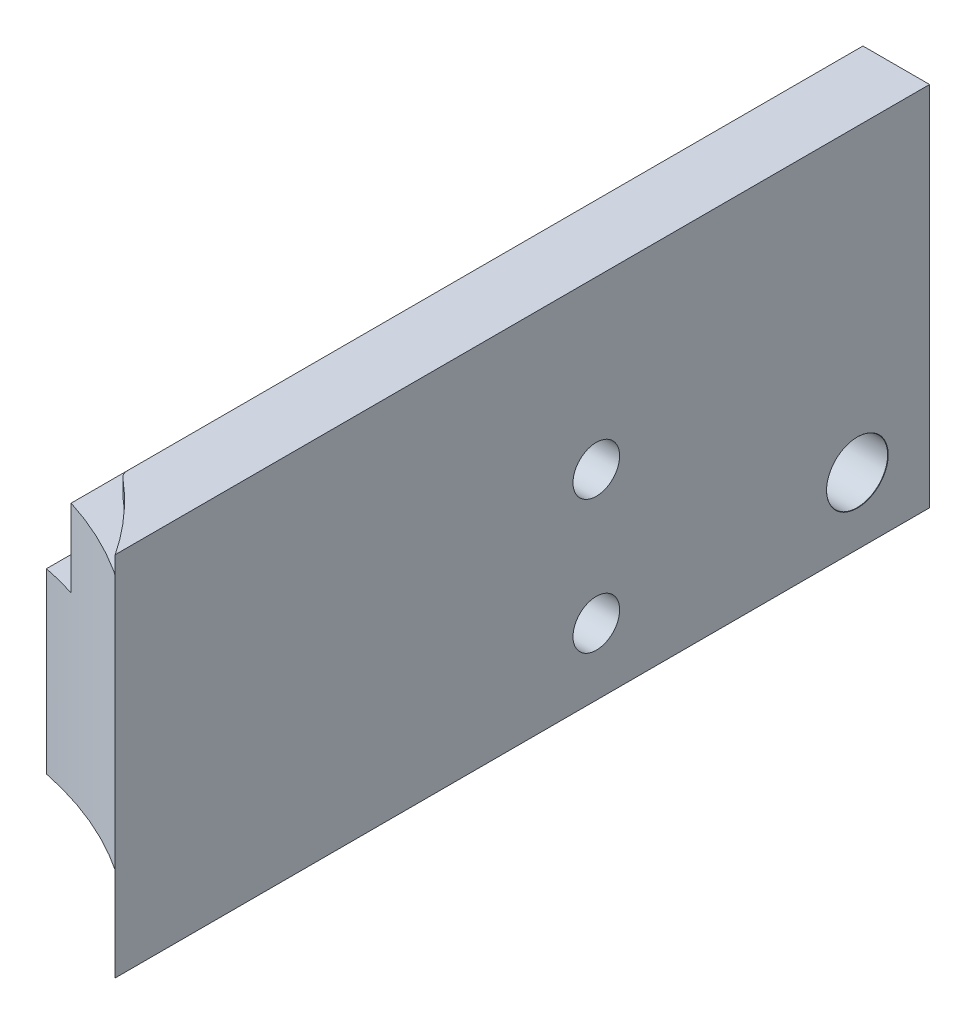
ISO-10303-21;
HEADER;
FILE_DESCRIPTION(('STEP AP214'),'2;1');
FILE_NAME('part.step','',(''),(''),'','','');
FILE_SCHEMA(('AUTOMOTIVE_DESIGN { 1 0 10303 214 1 1 1 1 }'));
ENDSEC;
DATA;
#1=APPLICATION_CONTEXT('core data for automotive mechanical design processes');
#2=APPLICATION_PROTOCOL_DEFINITION('international standard','automotive_design',2000,#1);
#3=PRODUCT_CONTEXT('',#1,'mechanical');
#4=PRODUCT('Part','Part','',(#3));
#5=PRODUCT_RELATED_PRODUCT_CATEGORY('part','',(#4));
#6=PRODUCT_DEFINITION_FORMATION('','',#4);
#7=PRODUCT_DEFINITION_CONTEXT('part definition',#1,'design');
#8=PRODUCT_DEFINITION('design','',#6,#7);
#9=PRODUCT_DEFINITION_SHAPE('','',#8);
#10=(LENGTH_UNIT() NAMED_UNIT(*) SI_UNIT(.MILLI.,.METRE.));
#11=(NAMED_UNIT(*) PLANE_ANGLE_UNIT() SI_UNIT($,.RADIAN.));
#12=(NAMED_UNIT(*) SI_UNIT($,.STERADIAN.) SOLID_ANGLE_UNIT());
#13=UNCERTAINTY_MEASURE_WITH_UNIT(LENGTH_MEASURE(1.E-05),#10,'distance_accuracy_value','');
#14=(GEOMETRIC_REPRESENTATION_CONTEXT(3) GLOBAL_UNCERTAINTY_ASSIGNED_CONTEXT((#13)) GLOBAL_UNIT_ASSIGNED_CONTEXT((#10,
#11,#12)) REPRESENTATION_CONTEXT('',''));
#15=CARTESIAN_POINT('',(0.,0.,0.));
#16=DIRECTION('',(0.,0.,1.));
#17=DIRECTION('',(1.,0.,0.));
#18=AXIS2_PLACEMENT_3D('',#15,#16,#17);
#19=CARTESIAN_POINT('',(0.,0.,0.));
#20=DIRECTION('',(0.,0.,1.));
#21=DIRECTION('',(1.,0.,0.));
#22=AXIS2_PLACEMENT_3D('',#19,#20,#21);
#23=PLANE('',#22);
#24=DIRECTION('',(-1.,0.,0.));
#25=VECTOR('',#24,1.);
#26=CARTESIAN_POINT('',(-175.,234.05458814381,0.));
#27=LINE('',#26,#25);
#28=CARTESIAN_POINT('',(-175.,234.05458814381,0.));
#29=VERTEX_POINT('',#28);
#30=CARTESIAN_POINT('',(-178.,234.05458814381,0.));
#31=VERTEX_POINT('',#30);
#32=EDGE_CURVE('E174',#29,#31,#27,.T.);
#33=ORIENTED_EDGE('',*,*,#32,.F.);
#34=DIRECTION('',(0.,-1.,0.));
#35=VECTOR('',#34,1.);
#36=CARTESIAN_POINT('',(-175.,234.05458814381,0.));
#37=LINE('',#36,#35);
#38=CARTESIAN_POINT('',(-175.,241.05458814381,0.));
#39=VERTEX_POINT('',#38);
#40=EDGE_CURVE('E171',#39,#29,#37,.T.);
#41=ORIENTED_EDGE('',*,*,#40,.F.);
#42=DIRECTION('',(-1.,0.,0.));
#43=VECTOR('',#42,1.);
#44=CARTESIAN_POINT('',(-178.,241.05458814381,0.));
#45=LINE('',#44,#43);
#46=CARTESIAN_POINT('',(-165.,241.05458814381,0.));
#47=VERTEX_POINT('',#46);
#48=EDGE_CURVE('E185',#47,#39,#45,.T.);
#49=ORIENTED_EDGE('',*,*,#48,.F.);
#50=DIRECTION('',(0.,-1.,0.));
#51=VECTOR('',#50,1.);
#52=CARTESIAN_POINT('',(-165.,242.55458814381,0.));
#53=LINE('',#52,#51);
#54=CARTESIAN_POINT('',(-165.,242.55458814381,0.));
#55=VERTEX_POINT('',#54);
#56=EDGE_CURVE('E182',#55,#47,#53,.T.);
#57=ORIENTED_EDGE('',*,*,#56,.F.);
#58=DIRECTION('',(-1.,0.,0.));
#59=VECTOR('',#58,1.);
#60=CARTESIAN_POINT('',(-178.,242.55458814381,0.));
#61=LINE('',#60,#59);
#62=CARTESIAN_POINT('',(-163.5,242.55458814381,0.));
#63=VERTEX_POINT('',#62);
#64=EDGE_CURVE('E196',#63,#55,#61,.T.);
#65=ORIENTED_EDGE('',*,*,#64,.F.);
#66=DIRECTION('',(0.,-1.,0.));
#67=VECTOR('',#66,1.);
#68=CARTESIAN_POINT('',(-163.5,242.55458814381,0.));
#69=LINE('',#68,#67);
#70=CARTESIAN_POINT('',(-163.5,249.55458814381,0.));
#71=VERTEX_POINT('',#70);
#72=EDGE_CURVE('E193',#71,#63,#69,.T.);
#73=ORIENTED_EDGE('',*,*,#72,.F.);
#74=DIRECTION('',(1.,0.,0.));
#75=VECTOR('',#74,1.);
#76=CARTESIAN_POINT('',(-165.,249.55458814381,0.));
#77=LINE('',#76,#75);
#78=CARTESIAN_POINT('',(-165.,249.55458814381,0.));
#79=VERTEX_POINT('',#78);
#80=EDGE_CURVE('E190',#79,#71,#77,.T.);
#81=ORIENTED_EDGE('',*,*,#80,.F.);
#82=DIRECTION('',(0.,-1.,0.));
#83=VECTOR('',#82,1.);
#84=CARTESIAN_POINT('',(-165.,251.054588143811,0.));
#85=LINE('',#84,#83);
#86=CARTESIAN_POINT('',(-165.,251.054588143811,0.));
#87=VERTEX_POINT('',#86);
#88=EDGE_CURVE('E221',#87,#79,#85,.T.);
#89=ORIENTED_EDGE('',*,*,#88,.F.);
#90=DIRECTION('',(-1.,0.,0.));
#91=VECTOR('',#90,1.);
#92=CARTESIAN_POINT('',(-159.,251.054588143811,0.));
#93=LINE('',#92,#91);
#94=CARTESIAN_POINT('',(-159.,251.054588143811,0.));
#95=VERTEX_POINT('',#94);
#96=EDGE_CURVE('E218',#95,#87,#93,.T.);
#97=ORIENTED_EDGE('',*,*,#96,.F.);
#98=DIRECTION('',(0.,1.,0.));
#99=VECTOR('',#98,1.);
#100=CARTESIAN_POINT('',(-159.,218.05458814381,0.));
#101=LINE('',#100,#99);
#102=CARTESIAN_POINT('',(-159.,218.05458814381,0.));
#103=VERTEX_POINT('',#102);
#104=EDGE_CURVE('E215',#103,#95,#101,.T.);
#105=ORIENTED_EDGE('',*,*,#104,.F.);
#106=DIRECTION('',(1.,0.,0.));
#107=VECTOR('',#106,1.);
#108=CARTESIAN_POINT('',(-159.,218.05458814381,0.));
#109=LINE('',#108,#107);
#110=CARTESIAN_POINT('',(-178.,218.05458814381,0.));
#111=VERTEX_POINT('',#110);
#112=EDGE_CURVE('E226',#111,#103,#109,.T.);
#113=ORIENTED_EDGE('',*,*,#112,.F.);
#114=DIRECTION('',(0.,-1.,0.));
#115=VECTOR('',#114,1.);
#116=CARTESIAN_POINT('',(-178.,218.05458814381,0.));
#117=LINE('',#116,#115);
#118=EDGE_CURVE('E224',#31,#111,#117,.T.);
#119=ORIENTED_EDGE('',*,*,#118,.F.);
#120=EDGE_LOOP('',(#33,#41,#49,#57,#65,#73,#81,#89,#97,#105,#113,#119));
#121=FACE_BOUND('',#120,.T.);
#122=ADVANCED_FACE('F16',(#121),#23,.F.);
#123=CARTESIAN_POINT('',(-159.,218.05458814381,280.));
#124=DIRECTION('',(0.,1.,0.));
#125=DIRECTION('',(0.,0.,1.));
#126=AXIS2_PLACEMENT_3D('',#123,#124,#125);
#127=PLANE('',#126);
#128=DIRECTION('',(0.,0.,-1.));
#129=VECTOR('',#128,1.);
#130=CARTESIAN_POINT('',(-159.,218.05458814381,280.));
#131=LINE('',#130,#129);
#132=CARTESIAN_POINT('',(-159.,218.05458814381,73.3095307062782));
#133=VERTEX_POINT('',#132);
#134=EDGE_CURVE('E229',#133,#103,#131,.T.);
#135=ORIENTED_EDGE('',*,*,#134,.F.);
#136=CARTESIAN_POINT('',(-184.,218.05458814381,89.8926546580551));
#137=DIRECTION('',(0.,-1.,0.));
#138=DIRECTION('',(0.,0.,-1.));
#139=AXIS2_PLACEMENT_3D('',#136,#137,#138);
#140=CIRCLE('',#139,30.);
#141=CARTESIAN_POINT('',(-178.,218.05458814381,60.498777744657));
#142=VERTEX_POINT('',#141);
#143=EDGE_CURVE('E202',#142,#133,#140,.T.);
#144=ORIENTED_EDGE('',*,*,#143,.F.);
#145=DIRECTION('',(0.,0.,-1.));
#146=VECTOR('',#145,1.);
#147=CARTESIAN_POINT('',(-178.,218.05458814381,280.));
#148=LINE('',#147,#146);
#149=EDGE_CURVE('E231',#142,#111,#148,.T.);
#150=ORIENTED_EDGE('',*,*,#149,.T.);
#151=ORIENTED_EDGE('',*,*,#112,.T.);
#152=EDGE_LOOP('',(#135,#144,#150,#151));
#153=FACE_BOUND('',#152,.T.);
#154=ADVANCED_FACE('F305',(#153),#127,.F.);
#155=CARTESIAN_POINT('',(-178.,218.05458814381,280.));
#156=DIRECTION('',(1.,0.,0.));
#157=DIRECTION('',(0.,0.,-1.));
#158=AXIS2_PLACEMENT_3D('',#155,#156,#157);
#159=PLANE('',#158);
#160=CARTESIAN_POINT('',(-178.,224.05458814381,6.5));
#161=DIRECTION('',(-1.,0.,0.));
#162=DIRECTION('',(0.,0.,1.));
#163=AXIS2_PLACEMENT_3D('',#160,#161,#162);
#164=CIRCLE('',#163,5.025);
#165=CARTESIAN_POINT('',(-178.,224.05458814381,11.525));
#166=VERTEX_POINT('',#165);
#167=EDGE_CURVE('E153',#166,#166,#164,.T.);
#168=ORIENTED_EDGE('',*,*,#167,.F.);
#169=EDGE_LOOP('',(#168));
#170=FACE_BOUND('',#169,.T.);
#171=DIRECTION('',(0.,-1.,0.));
#172=VECTOR('',#171,1.);
#173=CARTESIAN_POINT('',(-178.,278.054588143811,60.498777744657));
#174=LINE('',#173,#172);
#175=CARTESIAN_POINT('',(-178.,234.05458814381,60.498777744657));
#176=VERTEX_POINT('',#175);
#177=EDGE_CURVE('E207',#142,#176,#174,.F.);
#178=ORIENTED_EDGE('',*,*,#177,.T.);
#179=DIRECTION('',(0.,0.,-1.));
#180=VECTOR('',#179,1.);
#181=CARTESIAN_POINT('',(-178.,234.05458814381,73.3095307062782));
#182=LINE('',#181,#180);
#183=EDGE_CURVE('E177',#176,#31,#182,.T.);
#184=ORIENTED_EDGE('',*,*,#183,.T.);
#185=ORIENTED_EDGE('',*,*,#118,.T.);
#186=ORIENTED_EDGE('',*,*,#149,.F.);
#187=EDGE_LOOP('',(#178,#184,#185,#186));
#188=FACE_BOUND('',#187,.T.);
#189=ADVANCED_FACE('F301',(#170,#188),#159,.F.);
#190=CARTESIAN_POINT('',(-165.,251.054588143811,280.));
#191=DIRECTION('',(1.,0.,0.));
#192=DIRECTION('',(0.,0.,-1.));
#193=AXIS2_PLACEMENT_3D('',#190,#191,#192);
#194=PLANE('',#193);
#195=DIRECTION('',(0.,0.,-1.));
#196=VECTOR('',#195,1.);
#197=CARTESIAN_POINT('',(-165.,249.55458814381,73.3095307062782));
#198=LINE('',#197,#196);
#199=CARTESIAN_POINT('',(-165.,249.55458814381,66.2072160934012));
#200=VERTEX_POINT('',#199);
#201=EDGE_CURVE('E199',#200,#79,#198,.T.);
#202=ORIENTED_EDGE('',*,*,#201,.F.);
#203=DIRECTION('',(0.,-1.,0.));
#204=VECTOR('',#203,1.);
#205=CARTESIAN_POINT('',(-165.,251.054588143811,66.2072160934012));
#206=LINE('',#205,#204);
#207=CARTESIAN_POINT('',(-165.,251.054588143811,66.2072160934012));
#208=VERTEX_POINT('',#207);
#209=EDGE_CURVE('E261',#200,#208,#206,.F.);
#210=ORIENTED_EDGE('',*,*,#209,.T.);
#211=DIRECTION('',(0.,0.,-1.));
#212=VECTOR('',#211,1.);
#213=CARTESIAN_POINT('',(-165.,251.054588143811,280.));
#214=LINE('',#213,#212);
#215=EDGE_CURVE('E234',#208,#87,#214,.T.);
#216=ORIENTED_EDGE('',*,*,#215,.T.);
#217=ORIENTED_EDGE('',*,*,#88,.T.);
#218=EDGE_LOOP('',(#202,#210,#216,#217));
#219=FACE_BOUND('',#218,.T.);
#220=ADVANCED_FACE('F326',(#219),#194,.F.);
#221=CARTESIAN_POINT('',(-159.,251.054588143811,280.));
#222=DIRECTION('',(0.,-1.,0.));
#223=DIRECTION('',(0.,0.,-1.));
#224=AXIS2_PLACEMENT_3D('',#221,#222,#223);
#225=PLANE('',#224);
#226=ORIENTED_EDGE('',*,*,#215,.F.);
#227=CARTESIAN_POINT('',(-164.,251.054588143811,66.2072160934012));
#228=DIRECTION('',(0.,-1.,0.));
#229=DIRECTION('',(0.,0.,-1.));
#230=AXIS2_PLACEMENT_3D('',#227,#228,#229);
#231=CIRCLE('',#230,1.);
#232=CARTESIAN_POINT('',(-164.645161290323,251.054588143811,66.9712624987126));
#233=VERTEX_POINT('',#232);
#234=EDGE_CURVE('E264',#208,#233,#231,.F.);
#235=ORIENTED_EDGE('',*,*,#234,.T.);
#236=CARTESIAN_POINT('',(-184.,251.054588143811,89.8926546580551));
#237=DIRECTION('',(0.,-1.,0.));
#238=DIRECTION('',(0.,0.,-1.));
#239=AXIS2_PLACEMENT_3D('',#236,#237,#238);
#240=CIRCLE('',#239,30.);
#241=CARTESIAN_POINT('',(-159.,251.054588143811,73.3095307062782));
#242=VERTEX_POINT('',#241);
#243=EDGE_CURVE('E210',#233,#242,#240,.T.);
#244=ORIENTED_EDGE('',*,*,#243,.T.);
#245=DIRECTION('',(0.,0.,-1.));
#246=VECTOR('',#245,1.);
#247=CARTESIAN_POINT('',(-159.,251.054588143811,280.));
#248=LINE('',#247,#246);
#249=EDGE_CURVE('E236',#242,#95,#248,.T.);
#250=ORIENTED_EDGE('',*,*,#249,.T.);
#251=ORIENTED_EDGE('',*,*,#96,.T.);
#252=EDGE_LOOP('',(#226,#235,#244,#250,#251));
#253=FACE_BOUND('',#252,.T.);
#254=ADVANCED_FACE('F360',(#253),#225,.F.);
#255=CARTESIAN_POINT('',(-159.,218.05458814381,280.));
#256=DIRECTION('',(-1.,0.,0.));
#257=DIRECTION('',(0.,0.,1.));
#258=AXIS2_PLACEMENT_3D('',#255,#256,#257);
#259=PLANE('',#258);
#260=CARTESIAN_POINT('',(-159.,236.05458814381,30.));
#261=DIRECTION('',(1.,0.,0.));
#262=DIRECTION('',(0.,0.,-1.));
#263=AXIS2_PLACEMENT_3D('',#260,#261,#262);
#264=CIRCLE('',#263,2.1);
#265=CARTESIAN_POINT('',(-159.,236.05458814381,27.9));
#266=VERTEX_POINT('',#265);
#267=EDGE_CURVE('E140',#266,#266,#264,.T.);
#268=ORIENTED_EDGE('',*,*,#267,.F.);
#269=EDGE_LOOP('',(#268));
#270=FACE_BOUND('',#269,.T.);
#271=CARTESIAN_POINT('',(-159.,224.05458814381,30.));
#272=DIRECTION('',(1.,0.,0.));
#273=DIRECTION('',(0.,0.,-1.));
#274=AXIS2_PLACEMENT_3D('',#271,#272,#273);
#275=CIRCLE('',#274,2.1);
#276=CARTESIAN_POINT('',(-159.,224.05458814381,27.9));
#277=VERTEX_POINT('',#276);
#278=EDGE_CURVE('E139',#277,#277,#275,.T.);
#279=ORIENTED_EDGE('',*,*,#278,.F.);
#280=EDGE_LOOP('',(#279));
#281=FACE_BOUND('',#280,.T.);
#282=CARTESIAN_POINT('',(-159.,224.05458814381,6.5));
#283=DIRECTION('',(-1.,0.,0.));
#284=DIRECTION('',(0.,0.,1.));
#285=AXIS2_PLACEMENT_3D('',#282,#283,#284);
#286=CIRCLE('',#285,2.775);
#287=CARTESIAN_POINT('',(-159.,224.05458814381,9.275));
#288=VERTEX_POINT('',#287);
#289=EDGE_CURVE('E150',#288,#288,#286,.T.);
#290=ORIENTED_EDGE('',*,*,#289,.T.);
#291=EDGE_LOOP('',(#290));
#292=FACE_BOUND('',#291,.T.);
#293=ORIENTED_EDGE('',*,*,#249,.F.);
#294=DIRECTION('',(0.,-1.,0.));
#295=VECTOR('',#294,1.);
#296=CARTESIAN_POINT('',(-159.,278.054588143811,73.3095307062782));
#297=LINE('',#296,#295);
#298=EDGE_CURVE('E212',#242,#133,#297,.T.);
#299=ORIENTED_EDGE('',*,*,#298,.T.);
#300=ORIENTED_EDGE('',*,*,#134,.T.);
#301=ORIENTED_EDGE('',*,*,#104,.T.);
#302=EDGE_LOOP('',(#293,#299,#300,#301));
#303=FACE_BOUND('',#302,.T.);
#304=ADVANCED_FACE('F311',(#270,#281,#292,#303),#259,.F.);
#305=CARTESIAN_POINT('',(-184.,278.054588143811,89.8926546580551));
#306=DIRECTION('',(0.,-1.,0.));
#307=DIRECTION('',(0.,0.,-1.));
#308=AXIS2_PLACEMENT_3D('',#305,#306,#307);
#309=CYLINDRICAL_SURFACE('',#308,30.);
#310=CARTESIAN_POINT('',(-184.,241.05458814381,89.8926546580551));
#311=DIRECTION('',(0.,-1.,0.));
#312=DIRECTION('',(0.,0.,-1.));
#313=AXIS2_PLACEMENT_3D('',#310,#311,#312);
#314=CIRCLE('',#313,30.);
#315=CARTESIAN_POINT('',(-164.645161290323,241.05458814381,66.9712624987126));
#316=VERTEX_POINT('',#315);
#317=CARTESIAN_POINT('',(-175.,241.05458814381,61.2744786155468));
#318=VERTEX_POINT('',#317);
#319=EDGE_CURVE('E246',#316,#318,#314,.F.);
#320=ORIENTED_EDGE('',*,*,#319,.T.);
#321=DIRECTION('',(0.,-1.,0.));
#322=VECTOR('',#321,1.);
#323=CARTESIAN_POINT('',(-175.,278.054588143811,61.2744786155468));
#324=LINE('',#323,#322);
#325=CARTESIAN_POINT('',(-175.,234.05458814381,61.2744786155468));
#326=VERTEX_POINT('',#325);
#327=EDGE_CURVE('E31',#318,#326,#324,.T.);
#328=ORIENTED_EDGE('',*,*,#327,.T.);
#329=CARTESIAN_POINT('',(-184.,234.05458814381,89.8926546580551));
#330=DIRECTION('',(0.,-1.,0.));
#331=DIRECTION('',(0.,0.,-1.));
#332=AXIS2_PLACEMENT_3D('',#329,#330,#331);
#333=CIRCLE('',#332,30.);
#334=EDGE_CURVE('E11',#326,#176,#333,.F.);
#335=ORIENTED_EDGE('',*,*,#334,.T.);
#336=ORIENTED_EDGE('',*,*,#177,.F.);
#337=ORIENTED_EDGE('',*,*,#143,.T.);
#338=ORIENTED_EDGE('',*,*,#298,.F.);
#339=ORIENTED_EDGE('',*,*,#243,.F.);
#340=DIRECTION('',(0.,-1.,0.));
#341=VECTOR('',#340,1.);
#342=CARTESIAN_POINT('',(-164.645161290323,278.054588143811,66.9712624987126));
#343=LINE('',#342,#341);
#344=CARTESIAN_POINT('',(-164.645161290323,249.55458814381,66.9712624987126));
#345=VERTEX_POINT('',#344);
#346=EDGE_CURVE('E252',#233,#345,#343,.T.);
#347=ORIENTED_EDGE('',*,*,#346,.T.);
#348=CARTESIAN_POINT('',(-184.,249.55458814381,89.8926546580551));
#349=DIRECTION('',(0.,1.,0.));
#350=DIRECTION('',(0.,0.,1.));
#351=AXIS2_PLACEMENT_3D('',#348,#349,#350);
#352=CIRCLE('',#351,30.);
#353=CARTESIAN_POINT('',(-163.193548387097,249.55458814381,68.2803532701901));
#354=VERTEX_POINT('',#353);
#355=EDGE_CURVE('E238',#345,#354,#352,.F.);
#356=ORIENTED_EDGE('',*,*,#355,.T.);
#357=DIRECTION('',(0.,-1.,0.));
#358=VECTOR('',#357,1.);
#359=CARTESIAN_POINT('',(-163.193548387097,278.054588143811,68.2803532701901));
#360=LINE('',#359,#358);
#361=CARTESIAN_POINT('',(-163.193548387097,242.55458814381,68.2803532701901));
#362=VERTEX_POINT('',#361);
#363=EDGE_CURVE('E249',#354,#362,#360,.T.);
#364=ORIENTED_EDGE('',*,*,#363,.T.);
#365=CARTESIAN_POINT('',(-184.,242.55458814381,89.8926546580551));
#366=DIRECTION('',(0.,-1.,0.));
#367=DIRECTION('',(0.,0.,-1.));
#368=AXIS2_PLACEMENT_3D('',#365,#366,#367);
#369=CIRCLE('',#368,30.);
#370=CARTESIAN_POINT('',(-164.645161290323,242.55458814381,66.9712624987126));
#371=VERTEX_POINT('',#370);
#372=EDGE_CURVE('E240',#362,#371,#369,.F.);
#373=ORIENTED_EDGE('',*,*,#372,.T.);
#374=DIRECTION('',(0.,-1.,0.));
#375=VECTOR('',#374,1.);
#376=CARTESIAN_POINT('',(-164.645161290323,278.054588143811,66.9712624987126));
#377=LINE('',#376,#375);
#378=EDGE_CURVE('E254',#371,#316,#377,.T.);
#379=ORIENTED_EDGE('',*,*,#378,.T.);
#380=EDGE_LOOP('',(#320,#328,#335,#336,#337,#338,#339,#347,#356,#364,#373,#379));
#381=FACE_BOUND('',#380,.T.);
#382=ADVANCED_FACE('F281',(#381),#309,.F.);
#383=CARTESIAN_POINT('',(-178.,242.55458814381,73.3095307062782));
#384=DIRECTION('',(0.,-1.,0.));
#385=DIRECTION('',(0.,0.,-1.));
#386=AXIS2_PLACEMENT_3D('',#383,#384,#385);
#387=PLANE('',#386);
#388=DIRECTION('',(0.,0.,1.));
#389=VECTOR('',#388,1.);
#390=CARTESIAN_POINT('',(-165.,242.55458814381,73.3095307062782));
#391=LINE('',#390,#389);
#392=CARTESIAN_POINT('',(-165.,242.55458814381,66.2072160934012));
#393=VERTEX_POINT('',#392);
#394=EDGE_CURVE('E243',#55,#393,#391,.T.);
#395=ORIENTED_EDGE('',*,*,#394,.T.);
#396=CARTESIAN_POINT('',(-164.,242.55458814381,66.2072160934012));
#397=DIRECTION('',(0.,-1.,0.));
#398=DIRECTION('',(0.,0.,-1.));
#399=AXIS2_PLACEMENT_3D('',#396,#397,#398);
#400=CIRCLE('',#399,1.);
#401=EDGE_CURVE('E259',#393,#371,#400,.F.);
#402=ORIENTED_EDGE('',*,*,#401,.T.);
#403=ORIENTED_EDGE('',*,*,#372,.F.);
#404=CARTESIAN_POINT('',(-162.5,242.55458814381,67.5599432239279));
#405=DIRECTION('',(0.,-1.,0.));
#406=DIRECTION('',(0.,0.,-1.));
#407=AXIS2_PLACEMENT_3D('',#404,#405,#406);
#408=CIRCLE('',#407,1.);
#409=CARTESIAN_POINT('',(-163.5,242.55458814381,67.5599432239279));
#410=VERTEX_POINT('',#409);
#411=EDGE_CURVE('E271',#362,#410,#408,.T.);
#412=ORIENTED_EDGE('',*,*,#411,.T.);
#413=DIRECTION('',(0.,0.,-1.));
#414=VECTOR('',#413,1.);
#415=CARTESIAN_POINT('',(-163.5,242.55458814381,73.3095307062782));
#416=LINE('',#415,#414);
#417=EDGE_CURVE('E200',#410,#63,#416,.T.);
#418=ORIENTED_EDGE('',*,*,#417,.T.);
#419=ORIENTED_EDGE('',*,*,#64,.T.);
#420=EDGE_LOOP('',(#395,#402,#403,#412,#418,#419));
#421=FACE_BOUND('',#420,.T.);
#422=ADVANCED_FACE('F334',(#421),#387,.F.);
#423=CARTESIAN_POINT('',(-163.5,242.55458814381,73.3095307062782));
#424=DIRECTION('',(1.,0.,0.));
#425=DIRECTION('',(0.,0.,-1.));
#426=AXIS2_PLACEMENT_3D('',#423,#424,#425);
#427=PLANE('',#426);
#428=ORIENTED_EDGE('',*,*,#417,.F.);
#429=DIRECTION('',(0.,-1.,0.));
#430=VECTOR('',#429,1.);
#431=CARTESIAN_POINT('',(-163.5,242.55458814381,67.5599432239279));
#432=LINE('',#431,#430);
#433=CARTESIAN_POINT('',(-163.5,249.55458814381,67.5599432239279));
#434=VERTEX_POINT('',#433);
#435=EDGE_CURVE('E39',#410,#434,#432,.F.);
#436=ORIENTED_EDGE('',*,*,#435,.T.);
#437=DIRECTION('',(0.,0.,-1.));
#438=VECTOR('',#437,1.);
#439=CARTESIAN_POINT('',(-163.5,249.55458814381,73.3095307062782));
#440=LINE('',#439,#438);
#441=EDGE_CURVE('E203',#434,#71,#440,.T.);
#442=ORIENTED_EDGE('',*,*,#441,.T.);
#443=ORIENTED_EDGE('',*,*,#72,.T.);
#444=EDGE_LOOP('',(#428,#436,#442,#443));
#445=FACE_BOUND('',#444,.T.);
#446=ADVANCED_FACE('F335',(#445),#427,.F.);
#447=CARTESIAN_POINT('',(-165.,249.55458814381,73.3095307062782));
#448=DIRECTION('',(0.,1.,0.));
#449=DIRECTION('',(0.,0.,1.));
#450=AXIS2_PLACEMENT_3D('',#447,#448,#449);
#451=PLANE('',#450);
#452=ORIENTED_EDGE('',*,*,#355,.F.);
#453=CARTESIAN_POINT('',(-164.,249.55458814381,66.2072160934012));
#454=DIRECTION('',(0.,1.,0.));
#455=DIRECTION('',(0.,0.,1.));
#456=AXIS2_PLACEMENT_3D('',#453,#454,#455);
#457=CIRCLE('',#456,1.);
#458=EDGE_CURVE('E266',#345,#200,#457,.F.);
#459=ORIENTED_EDGE('',*,*,#458,.T.);
#460=ORIENTED_EDGE('',*,*,#201,.T.);
#461=ORIENTED_EDGE('',*,*,#80,.T.);
#462=ORIENTED_EDGE('',*,*,#441,.F.);
#463=CARTESIAN_POINT('',(-162.5,249.55458814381,67.5599432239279));
#464=DIRECTION('',(0.,1.,0.));
#465=DIRECTION('',(0.,0.,1.));
#466=AXIS2_PLACEMENT_3D('',#463,#464,#465);
#467=CIRCLE('',#466,1.);
#468=EDGE_CURVE('E273',#434,#354,#467,.T.);
#469=ORIENTED_EDGE('',*,*,#468,.T.);
#470=EDGE_LOOP('',(#452,#459,#460,#461,#462,#469));
#471=FACE_BOUND('',#470,.T.);
#472=ADVANCED_FACE('F323',(#471),#451,.F.);
#473=CARTESIAN_POINT('',(-178.,241.05458814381,73.3095307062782));
#474=DIRECTION('',(0.,-1.,0.));
#475=DIRECTION('',(0.,0.,-1.));
#476=AXIS2_PLACEMENT_3D('',#473,#474,#475);
#477=PLANE('',#476);
#478=ORIENTED_EDGE('',*,*,#48,.T.);
#479=DIRECTION('',(0.,0.,1.));
#480=VECTOR('',#479,1.);
#481=CARTESIAN_POINT('',(-175.,241.05458814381,73.3095307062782));
#482=LINE('',#481,#480);
#483=EDGE_CURVE('E24',#39,#318,#482,.T.);
#484=ORIENTED_EDGE('',*,*,#483,.T.);
#485=ORIENTED_EDGE('',*,*,#319,.F.);
#486=CARTESIAN_POINT('',(-164.,241.05458814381,66.2072160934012));
#487=DIRECTION('',(0.,-1.,0.));
#488=DIRECTION('',(0.,0.,-1.));
#489=AXIS2_PLACEMENT_3D('',#486,#487,#488);
#490=CIRCLE('',#489,1.);
#491=CARTESIAN_POINT('',(-165.,241.05458814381,66.2072160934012));
#492=VERTEX_POINT('',#491);
#493=EDGE_CURVE('E269',#316,#492,#490,.T.);
#494=ORIENTED_EDGE('',*,*,#493,.T.);
#495=DIRECTION('',(0.,0.,-1.));
#496=VECTOR('',#495,1.);
#497=CARTESIAN_POINT('',(-165.,241.05458814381,73.3095307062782));
#498=LINE('',#497,#496);
#499=EDGE_CURVE('E188',#492,#47,#498,.T.);
#500=ORIENTED_EDGE('',*,*,#499,.T.);
#501=EDGE_LOOP('',(#478,#484,#485,#494,#500));
#502=FACE_BOUND('',#501,.T.);
#503=ADVANCED_FACE('F276',(#502),#477,.F.);
#504=CARTESIAN_POINT('',(-165.,242.55458814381,73.3095307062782));
#505=DIRECTION('',(1.,0.,0.));
#506=DIRECTION('',(0.,0.,-1.));
#507=AXIS2_PLACEMENT_3D('',#504,#505,#506);
#508=PLANE('',#507);
#509=ORIENTED_EDGE('',*,*,#499,.F.);
#510=DIRECTION('',(0.,-1.,0.));
#511=VECTOR('',#510,1.);
#512=CARTESIAN_POINT('',(-165.,242.55458814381,66.2072160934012));
#513=LINE('',#512,#511);
#514=EDGE_CURVE('E257',#492,#393,#513,.F.);
#515=ORIENTED_EDGE('',*,*,#514,.T.);
#516=ORIENTED_EDGE('',*,*,#394,.F.);
#517=ORIENTED_EDGE('',*,*,#56,.T.);
#518=EDGE_LOOP('',(#509,#515,#516,#517));
#519=FACE_BOUND('',#518,.T.);
#520=ADVANCED_FACE('F289',(#519),#508,.F.);
#521=CARTESIAN_POINT('',(-164.,278.054588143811,66.2072160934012));
#522=DIRECTION('',(0.,-1.,0.));
#523=DIRECTION('',(0.,0.,-1.));
#524=AXIS2_PLACEMENT_3D('',#521,#522,#523);
#525=CYLINDRICAL_SURFACE('',#524,1.);
#526=ORIENTED_EDGE('',*,*,#401,.F.);
#527=ORIENTED_EDGE('',*,*,#514,.F.);
#528=ORIENTED_EDGE('',*,*,#493,.F.);
#529=ORIENTED_EDGE('',*,*,#378,.F.);
#530=EDGE_LOOP('',(#526,#527,#528,#529));
#531=FACE_BOUND('',#530,.T.);
#532=ADVANCED_FACE('F285',(#531),#525,.T.);
#533=CARTESIAN_POINT('',(-164.,278.054588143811,66.2072160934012));
#534=DIRECTION('',(0.,-1.,0.));
#535=DIRECTION('',(0.,0.,-1.));
#536=AXIS2_PLACEMENT_3D('',#533,#534,#535);
#537=CYLINDRICAL_SURFACE('',#536,1.);
#538=ORIENTED_EDGE('',*,*,#458,.F.);
#539=ORIENTED_EDGE('',*,*,#346,.F.);
#540=ORIENTED_EDGE('',*,*,#234,.F.);
#541=ORIENTED_EDGE('',*,*,#209,.F.);
#542=EDGE_LOOP('',(#538,#539,#540,#541));
#543=FACE_BOUND('',#542,.T.);
#544=ADVANCED_FACE('F319',(#543),#537,.T.);
#545=CARTESIAN_POINT('',(-162.5,278.054588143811,67.5599432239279));
#546=DIRECTION('',(0.,-1.,0.));
#547=DIRECTION('',(0.,0.,-1.));
#548=AXIS2_PLACEMENT_3D('',#545,#546,#547);
#549=CYLINDRICAL_SURFACE('',#548,1.);
#550=ORIENTED_EDGE('',*,*,#468,.F.);
#551=ORIENTED_EDGE('',*,*,#435,.F.);
#552=ORIENTED_EDGE('',*,*,#411,.F.);
#553=ORIENTED_EDGE('',*,*,#363,.F.);
#554=EDGE_LOOP('',(#550,#551,#552,#553));
#555=FACE_BOUND('',#554,.T.);
#556=ADVANCED_FACE('F18',(#555),#549,.T.);
#557=CARTESIAN_POINT('',(-175.,234.05458814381,73.3095307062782));
#558=DIRECTION('',(0.,-1.,0.));
#559=DIRECTION('',(0.,0.,-1.));
#560=AXIS2_PLACEMENT_3D('',#557,#558,#559);
#561=PLANE('',#560);
#562=DIRECTION('',(0.,0.,-1.));
#563=VECTOR('',#562,1.);
#564=CARTESIAN_POINT('',(-175.,234.05458814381,73.3095307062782));
#565=LINE('',#564,#563);
#566=EDGE_CURVE('E176',#326,#29,#565,.T.);
#567=ORIENTED_EDGE('',*,*,#566,.T.);
#568=ORIENTED_EDGE('',*,*,#32,.T.);
#569=ORIENTED_EDGE('',*,*,#183,.F.);
#570=ORIENTED_EDGE('',*,*,#334,.F.);
#571=EDGE_LOOP('',(#567,#568,#569,#570));
#572=FACE_BOUND('',#571,.T.);
#573=ADVANCED_FACE('F297',(#572),#561,.F.);
#574=CARTESIAN_POINT('',(-175.,234.05458814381,73.3095307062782));
#575=DIRECTION('',(1.,0.,0.));
#576=DIRECTION('',(0.,0.,-1.));
#577=AXIS2_PLACEMENT_3D('',#574,#575,#576);
#578=PLANE('',#577);
#579=ORIENTED_EDGE('',*,*,#483,.F.);
#580=ORIENTED_EDGE('',*,*,#40,.T.);
#581=ORIENTED_EDGE('',*,*,#566,.F.);
#582=ORIENTED_EDGE('',*,*,#327,.F.);
#583=EDGE_LOOP('',(#579,#580,#581,#582));
#584=FACE_BOUND('',#583,.T.);
#585=ADVANCED_FACE('F295',(#584),#578,.F.);
#586=CARTESIAN_POINT('',(-159.025,224.05458814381,6.5));
#587=DIRECTION('',(1.,0.,0.));
#588=DIRECTION('',(0.,0.,-1.));
#589=AXIS2_PLACEMENT_3D('',#586,#587,#588);
#590=CONICAL_SURFACE('',#589,2.75,0.785398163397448);
#591=ORIENTED_EDGE('',*,*,#289,.F.);
#592=EDGE_LOOP('',(#591));
#593=FACE_BOUND('',#592,.T.);
#594=CARTESIAN_POINT('',(-159.025,224.05458814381,6.5));
#595=DIRECTION('',(-1.,0.,0.));
#596=DIRECTION('',(0.,0.,1.));
#597=AXIS2_PLACEMENT_3D('',#594,#595,#596);
#598=CIRCLE('',#597,2.75);
#599=CARTESIAN_POINT('',(-159.025,224.05458814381,9.25));
#600=VERTEX_POINT('',#599);
#601=EDGE_CURVE('E168',#600,#600,#598,.T.);
#602=ORIENTED_EDGE('',*,*,#601,.T.);
#603=EDGE_LOOP('',(#602));
#604=FACE_BOUND('',#603,.T.);
#605=ADVANCED_FACE('F381',(#593,#604),#590,.F.);
#606=CARTESIAN_POINT('',(-178.,224.05458814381,6.5));
#607=DIRECTION('',(-1.,0.,0.));
#608=DIRECTION('',(0.,0.,1.));
#609=AXIS2_PLACEMENT_3D('',#606,#607,#608);
#610=CYLINDRICAL_SURFACE('',#609,2.75);
#611=ORIENTED_EDGE('',*,*,#601,.F.);
#612=EDGE_LOOP('',(#611));
#613=FACE_BOUND('',#612,.T.);
#614=CARTESIAN_POINT('',(-172.275,224.05458814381,6.5));
#615=DIRECTION('',(-1.,0.,0.));
#616=DIRECTION('',(0.,0.,1.));
#617=AXIS2_PLACEMENT_3D('',#614,#615,#616);
#618=CIRCLE('',#617,2.75);
#619=CARTESIAN_POINT('',(-172.275,224.05458814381,9.25));
#620=VERTEX_POINT('',#619);
#621=EDGE_CURVE('E165',#620,#620,#618,.T.);
#622=ORIENTED_EDGE('',*,*,#621,.T.);
#623=EDGE_LOOP('',(#622));
#624=FACE_BOUND('',#623,.T.);
#625=ADVANCED_FACE('F430',(#613,#624),#610,.F.);
#626=CARTESIAN_POINT('',(-172.3,224.05458814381,6.5));
#627=DIRECTION('',(-1.,0.,0.));
#628=DIRECTION('',(0.,0.,1.));
#629=AXIS2_PLACEMENT_3D('',#626,#627,#628);
#630=CONICAL_SURFACE('',#629,2.775,0.785398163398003);
#631=ORIENTED_EDGE('',*,*,#621,.F.);
#632=EDGE_LOOP('',(#631));
#633=FACE_BOUND('',#632,.T.);
#634=CARTESIAN_POINT('',(-172.3,224.05458814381,6.5));
#635=DIRECTION('',(-1.,0.,0.));
#636=DIRECTION('',(0.,0.,1.));
#637=AXIS2_PLACEMENT_3D('',#634,#635,#636);
#638=CIRCLE('',#637,2.775);
#639=CARTESIAN_POINT('',(-172.3,224.05458814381,9.275));
#640=VERTEX_POINT('',#639);
#641=EDGE_CURVE('E162',#640,#640,#638,.T.);
#642=ORIENTED_EDGE('',*,*,#641,.T.);
#643=EDGE_LOOP('',(#642));
#644=FACE_BOUND('',#643,.T.);
#645=ADVANCED_FACE('F440',(#633,#644),#630,.F.);
#646=CARTESIAN_POINT('',(-172.3,226.82958814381,6.5));
#647=DIRECTION('',(1.,0.,0.));
#648=DIRECTION('',(0.,0.,-1.));
#649=AXIS2_PLACEMENT_3D('',#646,#647,#648);
#650=PLANE('',#649);
#651=ORIENTED_EDGE('',*,*,#641,.F.);
#652=EDGE_LOOP('',(#651));
#653=FACE_BOUND('',#652,.T.);
#654=CARTESIAN_POINT('',(-172.3,224.05458814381,6.5));
#655=DIRECTION('',(-1.,0.,0.));
#656=DIRECTION('',(0.,0.,1.));
#657=AXIS2_PLACEMENT_3D('',#654,#655,#656);
#658=CIRCLE('',#657,5.);
#659=CARTESIAN_POINT('',(-172.3,224.05458814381,11.5));
#660=VERTEX_POINT('',#659);
#661=EDGE_CURVE('E159',#660,#660,#658,.T.);
#662=ORIENTED_EDGE('',*,*,#661,.T.);
#663=EDGE_LOOP('',(#662));
#664=FACE_BOUND('',#663,.T.);
#665=ADVANCED_FACE('F449',(#653,#664),#650,.F.);
#666=CARTESIAN_POINT('',(-178.,224.05458814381,6.5));
#667=DIRECTION('',(-1.,0.,0.));
#668=DIRECTION('',(0.,0.,1.));
#669=AXIS2_PLACEMENT_3D('',#666,#667,#668);
#670=CYLINDRICAL_SURFACE('',#669,5.);
#671=ORIENTED_EDGE('',*,*,#661,.F.);
#672=EDGE_LOOP('',(#671));
#673=FACE_BOUND('',#672,.T.);
#674=CARTESIAN_POINT('',(-177.975,224.05458814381,6.5));
#675=DIRECTION('',(-1.,0.,0.));
#676=DIRECTION('',(0.,0.,1.));
#677=AXIS2_PLACEMENT_3D('',#674,#675,#676);
#678=CIRCLE('',#677,5.);
#679=CARTESIAN_POINT('',(-177.975,224.05458814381,11.5));
#680=VERTEX_POINT('',#679);
#681=EDGE_CURVE('E156',#680,#680,#678,.T.);
#682=ORIENTED_EDGE('',*,*,#681,.T.);
#683=EDGE_LOOP('',(#682));
#684=FACE_BOUND('',#683,.T.);
#685=ADVANCED_FACE('F459',(#673,#684),#670,.F.);
#686=CARTESIAN_POINT('',(-178.,224.05458814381,6.5));
#687=DIRECTION('',(-1.,0.,0.));
#688=DIRECTION('',(0.,0.,1.));
#689=AXIS2_PLACEMENT_3D('',#686,#687,#688);
#690=CONICAL_SURFACE('',#689,5.025,0.785398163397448);
#691=ORIENTED_EDGE('',*,*,#681,.F.);
#692=EDGE_LOOP('',(#691));
#693=FACE_BOUND('',#692,.T.);
#694=ORIENTED_EDGE('',*,*,#167,.T.);
#695=EDGE_LOOP('',(#694));
#696=FACE_BOUND('',#695,.T.);
#697=ADVANCED_FACE('F469',(#693,#696),#690,.F.);
#698=CARTESIAN_POINT('',(-173.,224.05458814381,30.));
#699=DIRECTION('',(1.,0.,0.));
#700=DIRECTION('',(0.,0.,-1.));
#701=AXIS2_PLACEMENT_3D('',#698,#699,#700);
#702=CONICAL_SURFACE('',#701,2.1,1.02974425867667);
#703=CARTESIAN_POINT('',(-174.261807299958,224.05458814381,30.));
#704=VERTEX_POINT('',#703);
#705=VERTEX_LOOP('',#704);
#706=FACE_BOUND('',#705,.T.);
#707=CARTESIAN_POINT('',(-173.,224.05458814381,30.));
#708=DIRECTION('',(1.,0.,0.));
#709=DIRECTION('',(0.,0.,-1.));
#710=AXIS2_PLACEMENT_3D('',#707,#708,#709);
#711=CIRCLE('',#710,2.1);
#712=CARTESIAN_POINT('',(-173.,224.05458814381,27.9));
#713=VERTEX_POINT('',#712);
#714=EDGE_CURVE('E143',#713,#713,#711,.T.);
#715=ORIENTED_EDGE('',*,*,#714,.T.);
#716=EDGE_LOOP('',(#715));
#717=FACE_BOUND('',#716,.T.);
#718=ADVANCED_FACE('F479',(#706,#717),#702,.F.);
#719=CARTESIAN_POINT('',(-159.,224.05458814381,30.));
#720=DIRECTION('',(1.,0.,0.));
#721=DIRECTION('',(0.,0.,-1.));
#722=AXIS2_PLACEMENT_3D('',#719,#720,#721);
#723=CYLINDRICAL_SURFACE('',#722,2.1);
#724=ORIENTED_EDGE('',*,*,#714,.F.);
#725=EDGE_LOOP('',(#724));
#726=FACE_BOUND('',#725,.T.);
#727=ORIENTED_EDGE('',*,*,#278,.T.);
#728=EDGE_LOOP('',(#727));
#729=FACE_BOUND('',#728,.T.);
#730=ADVANCED_FACE('F133',(#726,#729),#723,.F.);
#731=CARTESIAN_POINT('',(-173.,236.05458814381,30.));
#732=DIRECTION('',(1.,0.,0.));
#733=DIRECTION('',(0.,0.,-1.));
#734=AXIS2_PLACEMENT_3D('',#731,#732,#733);
#735=CONICAL_SURFACE('',#734,2.1,1.02974425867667);
#736=CARTESIAN_POINT('',(-174.261807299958,236.05458814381,30.));
#737=VERTEX_POINT('',#736);
#738=VERTEX_LOOP('',#737);
#739=FACE_BOUND('',#738,.T.);
#740=CARTESIAN_POINT('',(-173.,236.05458814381,30.));
#741=DIRECTION('',(1.,0.,0.));
#742=DIRECTION('',(0.,0.,-1.));
#743=AXIS2_PLACEMENT_3D('',#740,#741,#742);
#744=CIRCLE('',#743,2.1);
#745=CARTESIAN_POINT('',(-173.,236.05458814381,27.9));
#746=VERTEX_POINT('',#745);
#747=EDGE_CURVE('E137',#746,#746,#744,.T.);
#748=ORIENTED_EDGE('',*,*,#747,.T.);
#749=EDGE_LOOP('',(#748));
#750=FACE_BOUND('',#749,.T.);
#751=ADVANCED_FACE('F129',(#739,#750),#735,.F.);
#752=CARTESIAN_POINT('',(-159.,236.05458814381,30.));
#753=DIRECTION('',(1.,0.,0.));
#754=DIRECTION('',(0.,0.,-1.));
#755=AXIS2_PLACEMENT_3D('',#752,#753,#754);
#756=CYLINDRICAL_SURFACE('',#755,2.1);
#757=ORIENTED_EDGE('',*,*,#747,.F.);
#758=EDGE_LOOP('',(#757));
#759=FACE_BOUND('',#758,.T.);
#760=ORIENTED_EDGE('',*,*,#267,.T.);
#761=EDGE_LOOP('',(#760));
#762=FACE_BOUND('',#761,.T.);
#763=ADVANCED_FACE('F132',(#759,#762),#756,.F.);
#764=CLOSED_SHELL('',(#122,#154,#189,#220,#254,#304,#382,#422,#446,#472,#503,#520,#532,#544,
#556,#573,#585,#605,#625,#645,#665,#685,#697,#718,#730,#751,#763));
#765=MANIFOLD_SOLID_BREP('B1',#764);
#766=ADVANCED_BREP_SHAPE_REPRESENTATION('',(#18,#765),#14);
#767=SHAPE_DEFINITION_REPRESENTATION(#9,#766);
ENDSEC;
END-ISO-10303-21;
